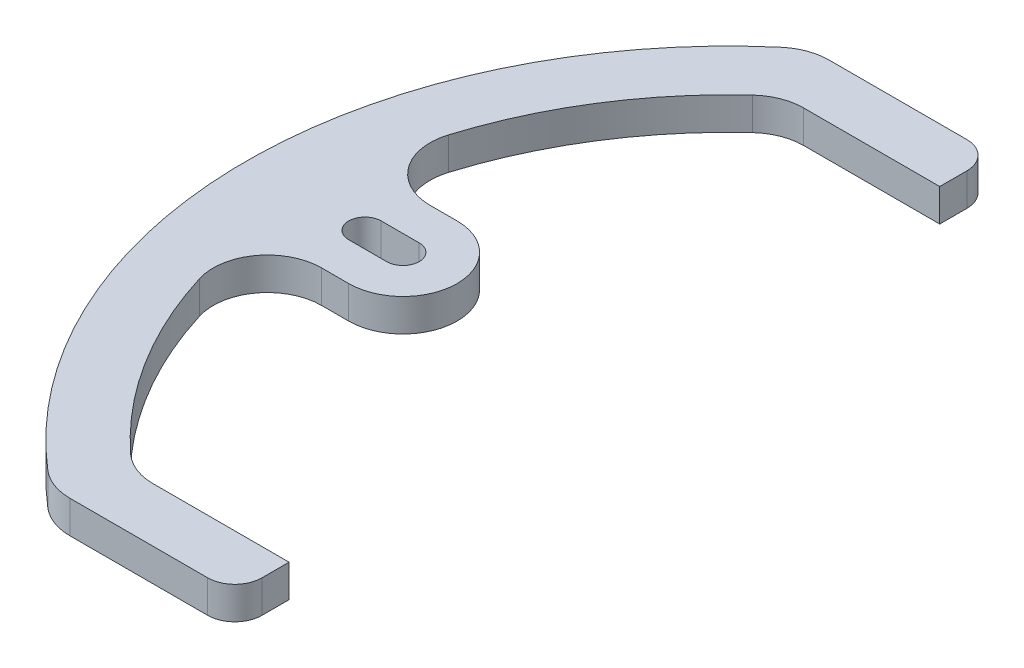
from build123d import *

# Parameters (mm, degrees)
EXTRUSION1_DEPTH = 6


with BuildPart() as part:
    # Esquisse1 → Extrusion1 (new body)
    with BuildSketch(Plane(origin=(0, 0, 0), x_dir=(1, 0, 0), z_dir=(0, 1, 0))):
        with BuildLine():
            Line((-75, 10), (-79.992307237, 10))
            ThreePointArc((-79.992307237, 10), (-88.036303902, 14.059114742), (-89.549999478, 22.941176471))
            ThreePointArc((-89.549999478, 22.941176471), (-80.989748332, 41.585491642), (-67.864356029, 57.352941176))
            ThreePointArc((-67.864356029, 57.352941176), (-64.724908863, 59.314757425), (-61.086874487, 60))
            Line((-61.086874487, 60), (-36, 60))
            Line((-36, 60), (-36, 65))
            ThreePointArc((-36, 65), (-37.464466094, 68.535533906), (-41, 70))
            Line((-41, 70), (-66.39066063, 70))
            ThreePointArc((-66.39066063, 70), (-69.858414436, 69.379482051), (-72.895807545, 67.594936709))
            ThreePointArc((-72.895807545, 67.594936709), (-104, 0), (-72.895807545, -67.594936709))
            ThreePointArc((-72.895807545, -67.594936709), (-69.858414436, -69.379482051), (-66.39066063, -70))
            Line((-66.39066063, -70), (-41, -70))
            ThreePointArc((-41, -70), (-37.464466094, -68.535533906), (-36, -65))
            Line((-36, -65), (-36, -60))
            Line((-36, -60), (-61.086874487, -60))
            ThreePointArc((-61.086874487, -60), (-64.724908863, -59.314757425), (-67.864356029, -57.352941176))
            ThreePointArc((-67.864356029, -57.352941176), (-80.989748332, -41.585491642), (-89.549999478, -22.941176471))
            ThreePointArc((-89.549999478, -22.941176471), (-88.036303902, -14.059114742), (-79.992307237, -10))
            Line((-79.992307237, -10), (-75, -10))
            ThreePointArc((-75, -10), (-65, 0), (-75, 10))
        make_face()
        with BuildLine():
            Line((-82, 3), (-75, 3))
            ThreePointArc((-75, 3), (-72, 0), (-75, -3))
            Line((-75, -3), (-82, -3))
            ThreePointArc((-82, -3), (-85, 0), (-82, 3))
        make_face(mode=Mode.SUBTRACT)
    extrude(amount=EXTRUSION1_DEPTH)


solid = part.part
